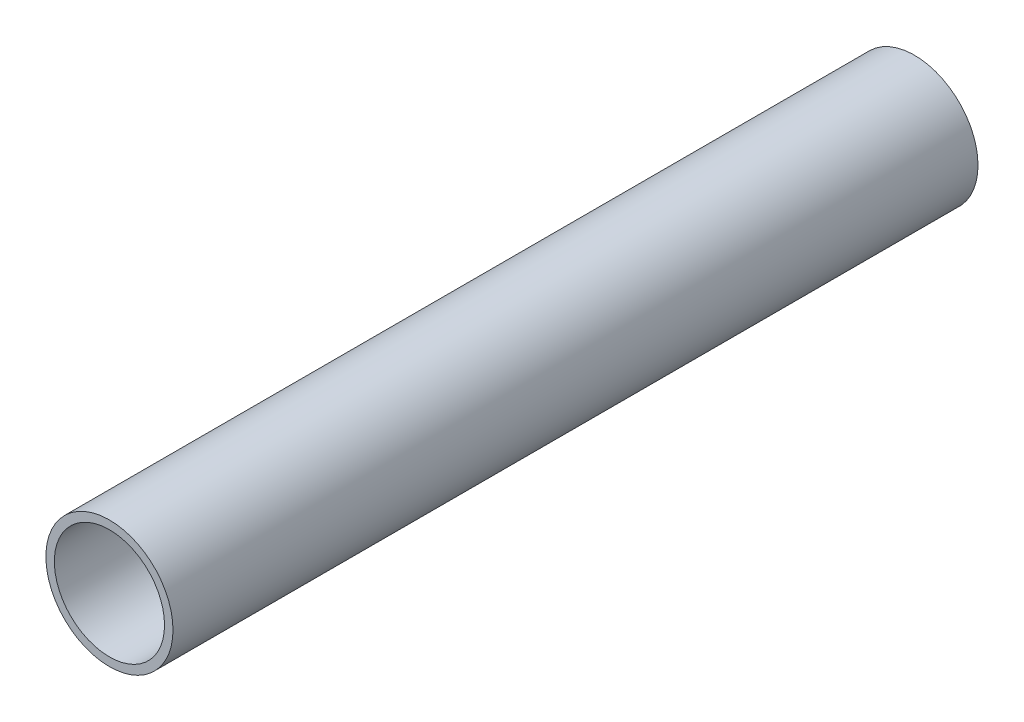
from build123d import *

# Parameters (mm, degrees)
SKETCH1_R           = 15
BOSS_EXTRUDE1_DEPTH = 190
SKETCH2_R           = 12.5
CUT_EXTRUDE1_DEPTH  = 210
SKETCH3_R           = 13
CUT_EXTRUDE2_DEPTH  = 192.180542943


with BuildPart() as part:
    # Sketch1 → Boss-Extrude1 (new body)
    with BuildSketch(Plane.XY):
        Circle(SKETCH1_R)
    extrude(amount=-BOSS_EXTRUDE1_DEPTH)

    # Sketch2 → Cut-Extrude1 (cut)
    with BuildSketch(Plane.XY):
        Circle(SKETCH2_R)
    extrude(amount=-CUT_EXTRUDE1_DEPTH, mode=Mode.SUBTRACT)

    # Sketch3 → Cut-Extrude2 (cut, through all)
    with BuildSketch(Plane.XY):
        Circle(SKETCH3_R)
    extrude(amount=-CUT_EXTRUDE2_DEPTH, mode=Mode.SUBTRACT)


solid = part.part
